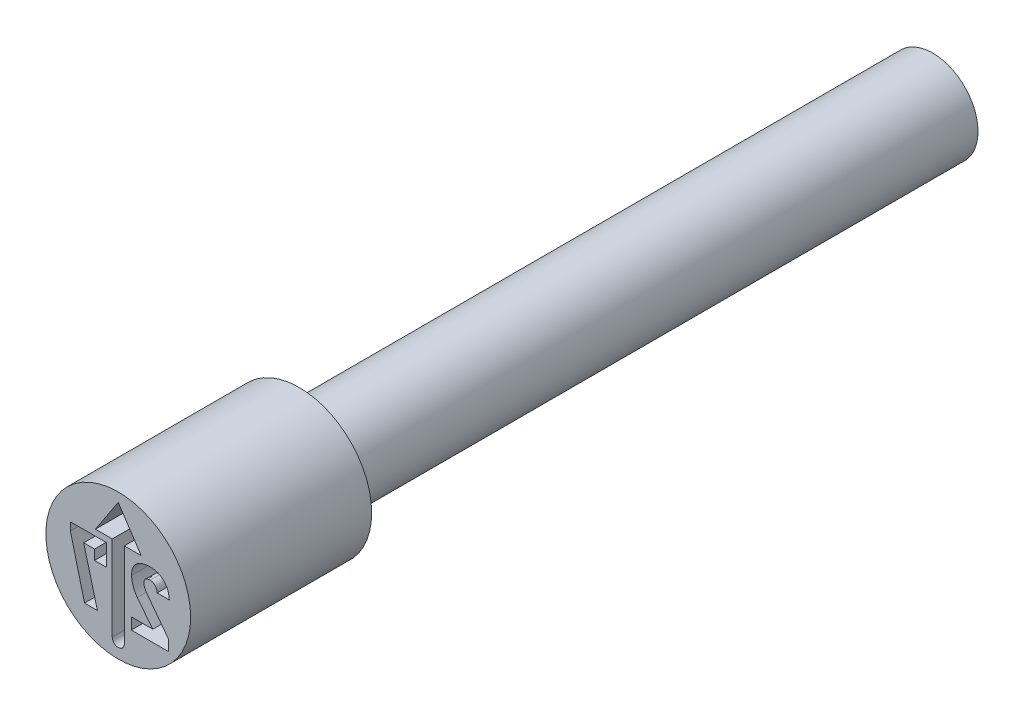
ISO-10303-21;
HEADER;
FILE_DESCRIPTION(('STEP AP214'),'2;1');
FILE_NAME('part.step','',(''),(''),'','','');
FILE_SCHEMA(('AUTOMOTIVE_DESIGN { 1 0 10303 214 1 1 1 1 }'));
ENDSEC;
DATA;
#1=APPLICATION_CONTEXT('core data for automotive mechanical design processes');
#2=APPLICATION_PROTOCOL_DEFINITION('international standard','automotive_design',2000,#1);
#3=PRODUCT_CONTEXT('',#1,'mechanical');
#4=PRODUCT('Part','Part','',(#3));
#5=PRODUCT_RELATED_PRODUCT_CATEGORY('part','',(#4));
#6=PRODUCT_DEFINITION_FORMATION('','',#4);
#7=PRODUCT_DEFINITION_CONTEXT('part definition',#1,'design');
#8=PRODUCT_DEFINITION('design','',#6,#7);
#9=PRODUCT_DEFINITION_SHAPE('','',#8);
#10=(LENGTH_UNIT() NAMED_UNIT(*) SI_UNIT(.MILLI.,.METRE.));
#11=(NAMED_UNIT(*) PLANE_ANGLE_UNIT() SI_UNIT($,.RADIAN.));
#12=(NAMED_UNIT(*) SI_UNIT($,.STERADIAN.) SOLID_ANGLE_UNIT());
#13=UNCERTAINTY_MEASURE_WITH_UNIT(LENGTH_MEASURE(1.E-05),#10,'distance_accuracy_value','');
#14=(GEOMETRIC_REPRESENTATION_CONTEXT(3) GLOBAL_UNCERTAINTY_ASSIGNED_CONTEXT((#13)) GLOBAL_UNIT_ASSIGNED_CONTEXT((#10,
#11,#12)) REPRESENTATION_CONTEXT('',''));
#15=CARTESIAN_POINT('',(0.,0.,0.));
#16=DIRECTION('',(0.,0.,1.));
#17=DIRECTION('',(1.,0.,0.));
#18=AXIS2_PLACEMENT_3D('',#15,#16,#17);
#19=CARTESIAN_POINT('',(0.,0.5,-2.));
#20=DIRECTION('',(0.,0.,1.));
#21=DIRECTION('',(1.,0.,0.));
#22=AXIS2_PLACEMENT_3D('',#19,#20,#21);
#23=PLANE('',#22);
#24=CARTESIAN_POINT('',(0.,0.,-2.));
#25=DIRECTION('',(0.,0.,1.));
#26=DIRECTION('',(1.,0.,0.));
#27=AXIS2_PLACEMENT_3D('',#24,#25,#26);
#28=CIRCLE('',#27,0.8);
#29=CARTESIAN_POINT('',(0.8,0.,-2.));
#30=VERTEX_POINT('',#29);
#31=EDGE_CURVE('E11',#30,#30,#28,.T.);
#32=ORIENTED_EDGE('',*,*,#31,.F.);
#33=EDGE_LOOP('',(#32));
#34=FACE_BOUND('',#33,.T.);
#35=CARTESIAN_POINT('',(0.,0.,-2.));
#36=DIRECTION('',(0.,0.,1.));
#37=DIRECTION('',(1.,0.,0.));
#38=AXIS2_PLACEMENT_3D('',#35,#36,#37);
#39=CIRCLE('',#38,0.5);
#40=CARTESIAN_POINT('',(0.5,0.,-2.));
#41=VERTEX_POINT('',#40);
#42=EDGE_CURVE('E430',#41,#41,#39,.T.);
#43=ORIENTED_EDGE('',*,*,#42,.T.);
#44=EDGE_LOOP('',(#43));
#45=FACE_BOUND('',#44,.T.);
#46=ADVANCED_FACE('F39',(#34,#45),#23,.F.);
#47=CARTESIAN_POINT('',(0.,0.,-0.403888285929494));
#48=DIRECTION('',(0.,0.,1.));
#49=DIRECTION('',(1.,0.,0.));
#50=AXIS2_PLACEMENT_3D('',#47,#48,#49);
#51=CYLINDRICAL_SURFACE('',#50,0.8);
#52=CARTESIAN_POINT('',(0.,0.,0.));
#53=DIRECTION('',(0.,0.,1.));
#54=DIRECTION('',(1.,0.,0.));
#55=AXIS2_PLACEMENT_3D('',#52,#53,#54);
#56=CIRCLE('',#55,0.8);
#57=CARTESIAN_POINT('',(0.8,0.,0.));
#58=VERTEX_POINT('',#57);
#59=EDGE_CURVE('E46',#58,#58,#56,.T.);
#60=ORIENTED_EDGE('',*,*,#59,.F.);
#61=EDGE_LOOP('',(#60));
#62=FACE_BOUND('',#61,.T.);
#63=ORIENTED_EDGE('',*,*,#31,.T.);
#64=EDGE_LOOP('',(#63));
#65=FACE_BOUND('',#64,.T.);
#66=ADVANCED_FACE('F415',(#62,#65),#51,.T.);
#67=CARTESIAN_POINT('',(0.,0.8,0.));
#68=DIRECTION('',(0.,0.,-1.));
#69=DIRECTION('',(-1.,0.,0.));
#70=AXIS2_PLACEMENT_3D('',#67,#68,#69);
#71=PLANE('',#70);
#72=DIRECTION('',(0.,-1.,0.));
#73=VECTOR('',#72,1.);
#74=CARTESIAN_POINT('',(-0.528963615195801,0.25,0.));
#75=LINE('',#74,#73);
#76=CARTESIAN_POINT('',(-0.528963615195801,0.25,0.));
#77=VERTEX_POINT('',#76);
#78=CARTESIAN_POINT('',(-0.528963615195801,0.162215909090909,0.));
#79=VERTEX_POINT('',#78);
#80=EDGE_CURVE('E297',#77,#79,#75,.T.);
#81=ORIENTED_EDGE('',*,*,#80,.F.);
#82=DIRECTION('',(-1.,0.,0.));
#83=VECTOR('',#82,1.);
#84=CARTESIAN_POINT('',(-0.130668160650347,0.25,0.));
#85=LINE('',#84,#83);
#86=CARTESIAN_POINT('',(-0.130668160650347,0.25,0.));
#87=VERTEX_POINT('',#86);
#88=EDGE_CURVE('E53',#87,#77,#85,.T.);
#89=ORIENTED_EDGE('',*,*,#88,.F.);
#90=DIRECTION('',(0.,1.,0.));
#91=VECTOR('',#90,1.);
#92=CARTESIAN_POINT('',(-0.130668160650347,0.0136363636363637,0.));
#93=LINE('',#92,#91);
#94=CARTESIAN_POINT('',(-0.130668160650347,0.0136363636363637,0.));
#95=VERTEX_POINT('',#94);
#96=EDGE_CURVE('E274',#95,#87,#93,.T.);
#97=ORIENTED_EDGE('',*,*,#96,.F.);
#98=DIRECTION('',(1.,0.,0.));
#99=VECTOR('',#98,1.);
#100=CARTESIAN_POINT('',(-0.262060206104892,0.0136363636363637,0.));
#101=LINE('',#100,#99);
#102=CARTESIAN_POINT('',(-0.262060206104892,0.0136363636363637,0.));
#103=VERTEX_POINT('',#102);
#104=EDGE_CURVE('E277',#103,#95,#101,.T.);
#105=ORIENTED_EDGE('',*,*,#104,.F.);
#106=DIRECTION('',(0.,-1.,0.));
#107=VECTOR('',#106,1.);
#108=CARTESIAN_POINT('',(-0.262060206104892,0.122727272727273,0.));
#109=LINE('',#108,#107);
#110=CARTESIAN_POINT('',(-0.262060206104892,0.122727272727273,0.));
#111=VERTEX_POINT('',#110);
#112=EDGE_CURVE('E311',#111,#103,#109,.T.);
#113=ORIENTED_EDGE('',*,*,#112,.F.);
#114=DIRECTION('',(1.,0.,0.));
#115=VECTOR('',#114,1.);
#116=CARTESIAN_POINT('',(-0.38180452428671,0.122727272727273,0.));
#117=LINE('',#116,#115);
#118=CARTESIAN_POINT('',(-0.38180452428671,0.122727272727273,0.));
#119=VERTEX_POINT('',#118);
#120=EDGE_CURVE('E308',#119,#111,#117,.T.);
#121=ORIENTED_EDGE('',*,*,#120,.F.);
#122=DIRECTION('',(-0.255602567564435,0.966781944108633,0.));
#123=VECTOR('',#122,1.);
#124=CARTESIAN_POINT('',(-0.230384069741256,-0.45,0.));
#125=LINE('',#124,#123);
#126=CARTESIAN_POINT('',(-0.230384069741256,-0.45,0.));
#127=VERTEX_POINT('',#126);
#128=EDGE_CURVE('E305',#127,#119,#125,.T.);
#129=ORIENTED_EDGE('',*,*,#128,.F.);
#130=DIRECTION('',(1.,0.,0.));
#131=VECTOR('',#130,1.);
#132=CARTESIAN_POINT('',(-0.372713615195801,-0.45,0.));
#133=LINE('',#132,#131);
#134=CARTESIAN_POINT('',(-0.372713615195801,-0.45,0.));
#135=VERTEX_POINT('',#134);
#136=EDGE_CURVE('E302',#135,#127,#133,.T.);
#137=ORIENTED_EDGE('',*,*,#136,.F.);
#138=DIRECTION('',(0.247293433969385,-0.968940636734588,0.));
#139=VECTOR('',#138,1.);
#140=CARTESIAN_POINT('',(-0.528963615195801,0.162215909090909,0.));
#141=LINE('',#140,#139);
#142=EDGE_CURVE('E299',#79,#135,#141,.T.);
#143=ORIENTED_EDGE('',*,*,#142,.F.);
#144=EDGE_LOOP('',(#81,#89,#97,#105,#113,#121,#129,#137,#143));
#145=FACE_BOUND('',#144,.T.);
#146=DIRECTION('',(0.,1.,0.));
#147=VECTOR('',#146,1.);
#148=CARTESIAN_POINT('',(0.55575797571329,-0.45,0.));
#149=LINE('',#148,#147);
#150=CARTESIAN_POINT('',(0.55575797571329,-0.45,0.));
#151=VERTEX_POINT('',#150);
#152=CARTESIAN_POINT('',(0.55575797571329,-0.330965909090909,0.));
#153=VERTEX_POINT('',#152);
#154=EDGE_CURVE('E602',#151,#153,#149,.T.);
#155=ORIENTED_EDGE('',*,*,#154,.F.);
#156=DIRECTION('',(1.,0.,0.));
#157=VECTOR('',#156,1.);
#158=CARTESIAN_POINT('',(0.143542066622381,-0.45,0.));
#159=LINE('',#158,#157);
#160=CARTESIAN_POINT('',(0.143542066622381,-0.45,0.));
#161=VERTEX_POINT('',#160);
#162=EDGE_CURVE('E61',#161,#151,#159,.T.);
#163=ORIENTED_EDGE('',*,*,#162,.F.);
#164=DIRECTION('',(0.,-1.,0.));
#165=VECTOR('',#164,1.);
#166=CARTESIAN_POINT('',(0.143542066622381,-0.322727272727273,0.));
#167=LINE('',#166,#165);
#168=CARTESIAN_POINT('',(0.143542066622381,-0.322727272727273,0.));
#169=VERTEX_POINT('',#168);
#170=EDGE_CURVE('E335',#169,#161,#167,.T.);
#171=ORIENTED_EDGE('',*,*,#170,.F.);
#172=DIRECTION('',(-1.,0.,0.));
#173=VECTOR('',#172,1.);
#174=CARTESIAN_POINT('',(0.381752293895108,-0.322727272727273,0.));
#175=LINE('',#174,#173);
#176=CARTESIAN_POINT('',(0.381752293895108,-0.322727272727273,0.));
#177=VERTEX_POINT('',#176);
#178=EDGE_CURVE('E530',#177,#169,#175,.T.);
#179=ORIENTED_EDGE('',*,*,#178,.F.);
#180=DIRECTION('',(0.618183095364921,-0.786034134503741,0.));
#181=VECTOR('',#180,1.);
#182=CARTESIAN_POINT('',(0.210161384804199,-0.104545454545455,0.));
#183=LINE('',#182,#181);
#184=CARTESIAN_POINT('',(0.210161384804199,-0.104545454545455,0.));
#185=VERTEX_POINT('',#184);
#186=EDGE_CURVE('E533',#185,#177,#183,.T.);
#187=ORIENTED_EDGE('',*,*,#186,.F.);
#188=CARTESIAN_POINT('',(0.147377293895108,0.0755681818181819,0.));
#189=CARTESIAN_POINT('',(0.147558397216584,0.0676034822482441,0.));
#190=CARTESIAN_POINT('',(0.147920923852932,0.0516600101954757,0.));
#191=CARTESIAN_POINT('',(0.151193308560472,0.027798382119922,0.));
#192=CARTESIAN_POINT('',(0.156466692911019,0.0040585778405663,0.));
#193=CARTESIAN_POINT('',(0.163708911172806,-0.0194447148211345,0.));
#194=CARTESIAN_POINT('',(0.172705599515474,-0.0423043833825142,0.));
#195=CARTESIAN_POINT('',(0.183503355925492,-0.0642073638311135,0.));
#196=CARTESIAN_POINT('',(0.195690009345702,-0.0851633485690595,0.));
#197=CARTESIAN_POINT('',(0.205346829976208,-0.0980971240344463,0.));
#198=CARTESIAN_POINT('',(0.210161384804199,-0.104545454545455,0.));
#199=B_SPLINE_CURVE_WITH_KNOTS('',3,(#188,#189,#190,#191,#192,#193,#194,#195,#196,#197,#198),
.UNSPECIFIED.,.F.,.F.,(4,1,1,1,1,1,1,1,4),(0.,0.123046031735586,0.246309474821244,
0.371480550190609,0.498560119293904,0.626024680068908,0.750715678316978,0.875715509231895,1.),.UNSPECIFIED.);
#200=CARTESIAN_POINT('',(0.147377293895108,0.0755681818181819,0.));
#201=VERTEX_POINT('',#200);
#202=EDGE_CURVE('E536',#201,#185,#199,.T.);
#203=ORIENTED_EDGE('',*,*,#202,.F.);
#204=DIRECTION('',(0.,-1.,0.));
#205=VECTOR('',#204,1.);
#206=CARTESIAN_POINT('',(0.147377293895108,0.0761363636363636,0.));
#207=LINE('',#206,#205);
#208=CARTESIAN_POINT('',(0.147377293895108,0.0761363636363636,0.));
#209=VERTEX_POINT('',#208);
#210=EDGE_CURVE('E541',#209,#201,#207,.T.);
#211=ORIENTED_EDGE('',*,*,#210,.F.);
#212=CARTESIAN_POINT('',(0.353485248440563,0.259090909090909,0.));
#213=CARTESIAN_POINT('',(0.345524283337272,0.258977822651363,0.));
#214=CARTESIAN_POINT('',(0.330041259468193,0.258757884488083,0.));
#215=CARTESIAN_POINT('',(0.307500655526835,0.256383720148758,0.));
#216=CARTESIAN_POINT('',(0.2862923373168,0.252800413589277,0.));
#217=CARTESIAN_POINT('',(0.266450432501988,0.24755820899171,0.));
#218=CARTESIAN_POINT('',(0.248054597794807,0.240720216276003,0.));
#219=CARTESIAN_POINT('',(0.231049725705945,0.232475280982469,0.));
#220=CARTESIAN_POINT('',(0.215400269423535,0.222753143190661,0.));
#221=CARTESIAN_POINT('',(0.20122607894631,0.211533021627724,0.));
#222=CARTESIAN_POINT('',(0.188472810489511,0.19901876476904,0.));
#223=CARTESIAN_POINT('',(0.177495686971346,0.185083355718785,0.));
#224=CARTESIAN_POINT('',(0.167993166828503,0.170008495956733,0.));
#225=CARTESIAN_POINT('',(0.160565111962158,0.153501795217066,0.));
#226=CARTESIAN_POINT('',(0.154449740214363,0.13595143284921,0.));
#227=CARTESIAN_POINT('',(0.150490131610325,0.117042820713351,0.));
#228=CARTESIAN_POINT('',(0.14782185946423,0.0969985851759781,0.));
#229=CARTESIAN_POINT('',(0.14752782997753,0.0832006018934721,0.));
#230=CARTESIAN_POINT('',(0.147377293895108,0.0761363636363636,0.));
#231=B_SPLINE_CURVE_WITH_KNOTS('',3,(#212,#213,#214,#215,#216,#217,#218,#219,#220,#221,#222,
#223,#224,#225,#226,#227,#228,#229,#230),.UNSPECIFIED.,.F.,.F.,(4,1,1,1,1,1,1,1,1,1,1,1,1,1,1,1,
4),(0.,0.0762312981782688,0.148259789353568,0.216860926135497,0.28210063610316,
0.344528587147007,0.404571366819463,0.462840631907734,0.520642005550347,0.577409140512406,
0.633580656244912,0.690215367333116,0.747647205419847,0.806597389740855,0.867894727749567,
0.932365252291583,1.),.UNSPECIFIED.);
#232=CARTESIAN_POINT('',(0.353485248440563,0.259090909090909,0.));
#233=VERTEX_POINT('',#232);
#234=EDGE_CURVE('E547',#233,#209,#231,.T.);
#235=ORIENTED_EDGE('',*,*,#234,.F.);
#236=CARTESIAN_POINT('',(0.564422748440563,0.0490056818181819,0.));
#237=CARTESIAN_POINT('',(0.563758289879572,0.0571196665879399,0.));
#238=CARTESIAN_POINT('',(0.562461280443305,0.0729579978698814,0.));
#239=CARTESIAN_POINT('',(0.558209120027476,0.0958688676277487,0.));
#240=CARTESIAN_POINT('',(0.552713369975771,0.117449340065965,0.));
#241=CARTESIAN_POINT('',(0.545722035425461,0.137695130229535,0.));
#242=CARTESIAN_POINT('',(0.536738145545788,0.156371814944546,0.));
#243=CARTESIAN_POINT('',(0.526644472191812,0.1738698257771,0.));
#244=CARTESIAN_POINT('',(0.51450431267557,0.189647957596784,0.));
#245=CARTESIAN_POINT('',(0.501215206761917,0.204234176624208,0.));
#246=CARTESIAN_POINT('',(0.486413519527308,0.217081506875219,0.));
#247=CARTESIAN_POINT('',(0.470630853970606,0.228414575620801,0.));
#248=CARTESIAN_POINT('',(0.45362855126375,0.237845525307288,0.));
#249=CARTESIAN_POINT('',(0.435665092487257,0.24566905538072,0.));
#250=CARTESIAN_POINT('',(0.416541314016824,0.251606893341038,0.));
#251=CARTESIAN_POINT('',(0.396507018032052,0.256054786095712,0.));
#252=CARTESIAN_POINT('',(0.375332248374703,0.258619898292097,0.));
#253=CARTESIAN_POINT('',(0.360878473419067,0.258931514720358,0.));
#254=CARTESIAN_POINT('',(0.353485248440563,0.259090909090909,0.));
#255=B_SPLINE_CURVE_WITH_KNOTS('',3,(#236,#237,#238,#239,#240,#241,#242,#243,#244,#245,#246,
#247,#248,#249,#250,#251,#252,#253,#254),.UNSPECIFIED.,.F.,.F.,(4,1,1,1,1,1,1,1,1,1,1,1,1,1,1,1,
4),(0.,0.0733268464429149,0.143132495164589,0.209679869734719,0.273918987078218,
0.33576228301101,0.396210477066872,0.455608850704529,0.514796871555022,0.573764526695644,
0.631900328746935,0.689592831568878,0.748648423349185,0.808163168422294,0.86976604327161,
0.933384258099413,1.),.UNSPECIFIED.);
#256=CARTESIAN_POINT('',(0.564422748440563,0.0490056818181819,0.));
#257=VERTEX_POINT('',#256);
#258=EDGE_CURVE('E552',#257,#233,#255,.T.);
#259=ORIENTED_EDGE('',*,*,#258,.F.);
#260=DIRECTION('',(0.,1.,0.));
#261=VECTOR('',#260,1.);
#262=CARTESIAN_POINT('',(0.564422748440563,0.0485795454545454,0.));
#263=LINE('',#262,#261);
#264=CARTESIAN_POINT('',(0.564422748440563,0.0485795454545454,0.));
#265=VERTEX_POINT('',#264);
#266=EDGE_CURVE('E560',#265,#257,#263,.T.);
#267=ORIENTED_EDGE('',*,*,#266,.F.);
#268=DIRECTION('',(1.,0.,0.));
#269=VECTOR('',#268,1.);
#270=CARTESIAN_POINT('',(0.429763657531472,0.0485795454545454,0.));
#271=LINE('',#270,#269);
#272=CARTESIAN_POINT('',(0.429763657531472,0.0485795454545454,0.));
#273=VERTEX_POINT('',#272);
#274=EDGE_CURVE('E566',#273,#265,#271,.T.);
#275=ORIENTED_EDGE('',*,*,#274,.F.);
#276=DIRECTION('',(0.,-1.,0.));
#277=VECTOR('',#276,1.);
#278=CARTESIAN_POINT('',(0.429763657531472,0.0490056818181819,0.));
#279=LINE('',#278,#277);
#280=CARTESIAN_POINT('',(0.429763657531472,0.0490056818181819,0.));
#281=VERTEX_POINT('',#280);
#282=EDGE_CURVE('E569',#281,#273,#279,.T.);
#283=ORIENTED_EDGE('',*,*,#282,.F.);
#284=CARTESIAN_POINT('',(0.352490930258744,0.131818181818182,0.));
#285=CARTESIAN_POINT('',(0.357636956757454,0.131617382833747,0.));
#286=CARTESIAN_POINT('',(0.367635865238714,0.131227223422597,0.));
#287=CARTESIAN_POINT('',(0.381791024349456,0.12690315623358,0.));
#288=CARTESIAN_POINT('',(0.394546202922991,0.12012054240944,0.));
#289=CARTESIAN_POINT('',(0.405542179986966,0.110442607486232,0.));
#290=CARTESIAN_POINT('',(0.414647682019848,0.0982915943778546,0.));
#291=CARTESIAN_POINT('',(0.422037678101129,0.0839827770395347,0.));
#292=CARTESIAN_POINT('',(0.427056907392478,0.0672578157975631,0.));
#293=CARTESIAN_POINT('',(0.42883237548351,0.0552854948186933,0.));
#294=CARTESIAN_POINT('',(0.429763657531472,0.0490056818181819,0.));
#295=B_SPLINE_CURVE_WITH_KNOTS('',3,(#284,#285,#286,#287,#288,#289,#290,#291,#292,#293,#294),
.UNSPECIFIED.,.F.,.F.,(4,1,1,1,1,1,1,1,4),(0.,0.122603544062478,0.238222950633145,
0.350089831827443,0.465559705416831,0.58502806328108,0.711014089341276,0.848418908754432,1.),.UNSPECIFIED.);
#296=CARTESIAN_POINT('',(0.352490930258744,0.131818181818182,0.));
#297=VERTEX_POINT('',#296);
#298=EDGE_CURVE('E572',#297,#281,#295,.T.);
#299=ORIENTED_EDGE('',*,*,#298,.F.);
#300=CARTESIAN_POINT('',(0.282604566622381,0.0724431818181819,0.));
#301=CARTESIAN_POINT('',(0.282798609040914,0.0769189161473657,0.));
#302=CARTESIAN_POINT('',(0.283170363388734,0.0854937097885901,0.));
#303=CARTESIAN_POINT('',(0.286672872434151,0.0975757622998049,0.));
#304=CARTESIAN_POINT('',(0.292413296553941,0.108097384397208,0.));
#305=CARTESIAN_POINT('',(0.30063496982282,0.116788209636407,0.));
#306=CARTESIAN_POINT('',(0.310870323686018,0.123662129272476,0.));
#307=CARTESIAN_POINT('',(0.323117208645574,0.128506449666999,0.));
#308=CARTESIAN_POINT('',(0.33721538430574,0.131284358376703,0.));
#309=CARTESIAN_POINT('',(0.347222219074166,0.13163405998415,0.));
#310=CARTESIAN_POINT('',(0.352490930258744,0.131818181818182,0.));
#311=B_SPLINE_CURVE_WITH_KNOTS('',3,(#300,#301,#302,#303,#304,#305,#306,#307,#308,#309,#310),
.UNSPECIFIED.,.F.,.F.,(4,1,1,1,1,1,1,1,4),(0.,0.128749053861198,0.246662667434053,
0.359069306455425,0.471077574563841,0.588039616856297,0.711712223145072,0.848213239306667,1.),.UNSPECIFIED.);
#312=CARTESIAN_POINT('',(0.282604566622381,0.0724431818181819,0.));
#313=VERTEX_POINT('',#312);
#314=EDGE_CURVE('E577',#313,#297,#311,.T.);
#315=ORIENTED_EDGE('',*,*,#314,.F.);
#316=DIRECTION('',(0.,1.,0.));
#317=VECTOR('',#316,1.);
#318=CARTESIAN_POINT('',(0.282604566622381,0.0714488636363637,0.));
#319=LINE('',#318,#317);
#320=CARTESIAN_POINT('',(0.282604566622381,0.0714488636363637,0.));
#321=VERTEX_POINT('',#320);
#322=EDGE_CURVE('E585',#321,#313,#319,.T.);
#323=ORIENTED_EDGE('',*,*,#322,.F.);
#324=CARTESIAN_POINT('',(0.316553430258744,-0.0140625,0.));
#325=CARTESIAN_POINT('',(0.311543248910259,-0.00700288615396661,0.));
#326=CARTESIAN_POINT('',(0.301781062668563,0.00675255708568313,0.));
#327=CARTESIAN_POINT('',(0.292945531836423,0.0256428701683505,0.));
#328=CARTESIAN_POINT('',(0.287441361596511,0.0404531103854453,0.));
#329=CARTESIAN_POINT('',(0.284818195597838,0.0511934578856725,0.));
#330=CARTESIAN_POINT('',(0.282946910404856,0.0614407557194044,0.));
#331=CARTESIAN_POINT('',(0.282716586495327,0.0681740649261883,0.));
#332=CARTESIAN_POINT('',(0.282604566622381,0.0714488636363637,0.));
#333=B_SPLINE_CURVE_WITH_KNOTS('',3,(#324,#325,#326,#327,#328,#329,#330,#331,#332),
.UNSPECIFIED.,.F.,.F.,(4,1,1,1,1,1,4),(0.,0.277375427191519,0.540457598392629,0.666416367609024,
0.784009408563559,0.894951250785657,1.),.UNSPECIFIED.);
#334=CARTESIAN_POINT('',(0.316553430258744,-0.0140625,0.));
#335=VERTEX_POINT('',#334);
#336=EDGE_CURVE('E591',#335,#321,#333,.T.);
#337=ORIENTED_EDGE('',*,*,#336,.F.);
#338=DIRECTION('',(-0.602458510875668,0.798150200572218,0.));
#339=VECTOR('',#338,1.);
#340=CARTESIAN_POINT('',(0.55575797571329,-0.330965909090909,0.));
#341=LINE('',#340,#339);
#342=EDGE_CURVE('E596',#153,#335,#341,.T.);
#343=ORIENTED_EDGE('',*,*,#342,.F.);
#344=EDGE_LOOP('',(#155,#163,#171,#179,#187,#203,#211,#235,#259,#267,#275,#283,#299,#315,#323,
#337,#343));
#345=FACE_BOUND('',#344,.T.);
#346=DIRECTION('',(0.,1.,0.));
#347=VECTOR('',#346,1.);
#348=CARTESIAN_POINT('',(0.0666655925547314,0.31722300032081,0.));
#349=LINE('',#348,#347);
#350=CARTESIAN_POINT('',(0.0666655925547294,-0.62165664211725,0.));
#351=VERTEX_POINT('',#350);
#352=CARTESIAN_POINT('',(0.0666655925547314,0.31722300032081,0.));
#353=VERTEX_POINT('',#352);
#354=EDGE_CURVE('E469',#351,#353,#349,.T.);
#355=ORIENTED_EDGE('',*,*,#354,.F.);
#356=CARTESIAN_POINT('',(0.,-0.62165664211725,0.));
#357=DIRECTION('',(0.,0.,1.));
#358=DIRECTION('',(1.,0.,0.));
#359=AXIS2_PLACEMENT_3D('',#356,#357,#358);
#360=CIRCLE('',#359,0.0666655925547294);
#361=CARTESIAN_POINT('',(-0.0666655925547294,-0.62165664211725,0.));
#362=VERTEX_POINT('',#361);
#363=EDGE_CURVE('E472',#362,#351,#360,.T.);
#364=ORIENTED_EDGE('',*,*,#363,.F.);
#365=DIRECTION('',(0.,-1.,0.));
#366=VECTOR('',#365,1.);
#367=CARTESIAN_POINT('',(-0.0666655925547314,0.31722300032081,0.));
#368=LINE('',#367,#366);
#369=CARTESIAN_POINT('',(-0.0666655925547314,0.31722300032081,0.));
#370=VERTEX_POINT('',#369);
#371=EDGE_CURVE('E453',#370,#362,#368,.T.);
#372=ORIENTED_EDGE('',*,*,#371,.F.);
#373=DIRECTION('',(1.,0.,0.));
#374=VECTOR('',#373,1.);
#375=CARTESIAN_POINT('',(-0.252671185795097,0.31722300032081,0.));
#376=LINE('',#375,#374);
#377=CARTESIAN_POINT('',(-0.252671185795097,0.31722300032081,0.));
#378=VERTEX_POINT('',#377);
#379=EDGE_CURVE('E457',#378,#370,#376,.T.);
#380=ORIENTED_EDGE('',*,*,#379,.F.);
#381=DIRECTION('',(-0.550159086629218,-0.835059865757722,0.));
#382=VECTOR('',#381,1.);
#383=CARTESIAN_POINT('',(0.,0.700740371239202,0.));
#384=LINE('',#383,#382);
#385=CARTESIAN_POINT('',(0.,0.700740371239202,0.));
#386=VERTEX_POINT('',#385);
#387=EDGE_CURVE('E460',#386,#378,#384,.T.);
#388=ORIENTED_EDGE('',*,*,#387,.F.);
#389=DIRECTION('',(-0.550159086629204,0.835059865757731,0.));
#390=VECTOR('',#389,1.);
#391=CARTESIAN_POINT('',(0.,0.700740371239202,0.));
#392=LINE('',#391,#390);
#393=CARTESIAN_POINT('',(0.252671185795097,0.31722300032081,0.));
#394=VERTEX_POINT('',#393);
#395=EDGE_CURVE('E463',#394,#386,#392,.T.);
#396=ORIENTED_EDGE('',*,*,#395,.F.);
#397=DIRECTION('',(1.,0.,0.));
#398=VECTOR('',#397,1.);
#399=CARTESIAN_POINT('',(0.252671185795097,0.31722300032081,0.));
#400=LINE('',#399,#398);
#401=EDGE_CURVE('E466',#353,#394,#400,.T.);
#402=ORIENTED_EDGE('',*,*,#401,.F.);
#403=EDGE_LOOP('',(#355,#364,#372,#380,#388,#396,#402));
#404=FACE_BOUND('',#403,.T.);
#405=ORIENTED_EDGE('',*,*,#59,.T.);
#406=EDGE_LOOP('',(#405));
#407=FACE_BOUND('',#406,.T.);
#408=ADVANCED_FACE('F412',(#145,#345,#404,#407),#71,.F.);
#409=CARTESIAN_POINT('',(0.,0.,-9.));
#410=DIRECTION('',(0.,0.,1.));
#411=DIRECTION('',(1.,0.,0.));
#412=AXIS2_PLACEMENT_3D('',#409,#410,#411);
#413=PLANE('',#412);
#414=CARTESIAN_POINT('',(0.,0.,-9.));
#415=DIRECTION('',(0.,0.,1.));
#416=DIRECTION('',(1.,0.,0.));
#417=AXIS2_PLACEMENT_3D('',#414,#415,#416);
#418=CIRCLE('',#417,0.500000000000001);
#419=CARTESIAN_POINT('',(0.500000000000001,0.,-9.));
#420=VERTEX_POINT('',#419);
#421=EDGE_CURVE('E431',#420,#420,#418,.T.);
#422=ORIENTED_EDGE('',*,*,#421,.F.);
#423=EDGE_LOOP('',(#422));
#424=FACE_BOUND('',#423,.T.);
#425=ADVANCED_FACE('F408',(#424),#413,.F.);
#426=CARTESIAN_POINT('',(0.,0.,-0.403888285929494));
#427=DIRECTION('',(0.,0.,1.));
#428=DIRECTION('',(1.,0.,0.));
#429=AXIS2_PLACEMENT_3D('',#426,#427,#428);
#430=CYLINDRICAL_SURFACE('',#429,0.5);
#431=ORIENTED_EDGE('',*,*,#42,.F.);
#432=EDGE_LOOP('',(#431));
#433=FACE_BOUND('',#432,.T.);
#434=ORIENTED_EDGE('',*,*,#421,.T.);
#435=EDGE_LOOP('',(#434));
#436=FACE_BOUND('',#435,.T.);
#437=ADVANCED_FACE('F404',(#433,#436),#430,.T.);
#438=CARTESIAN_POINT('',(0.,-0.62165664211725,-0.3));
#439=DIRECTION('',(0.,0.,1.));
#440=DIRECTION('',(1.,0.,0.));
#441=AXIS2_PLACEMENT_3D('',#438,#439,#440);
#442=CYLINDRICAL_SURFACE('',#441,0.0666655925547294);
#443=ORIENTED_EDGE('',*,*,#363,.T.);
#444=DIRECTION('',(0.,0.,1.));
#445=VECTOR('',#444,1.);
#446=CARTESIAN_POINT('',(0.0666655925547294,-0.62165664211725,-0.3));
#447=LINE('',#446,#445);
#448=CARTESIAN_POINT('',(0.0666655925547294,-0.62165664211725,-0.3));
#449=VERTEX_POINT('',#448);
#450=EDGE_CURVE('E439',#449,#351,#447,.T.);
#451=ORIENTED_EDGE('',*,*,#450,.F.);
#452=CARTESIAN_POINT('',(0.,-0.62165664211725,-0.3));
#453=DIRECTION('',(0.,0.,1.));
#454=DIRECTION('',(1.,0.,0.));
#455=AXIS2_PLACEMENT_3D('',#452,#453,#454);
#456=CIRCLE('',#455,0.0666655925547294);
#457=CARTESIAN_POINT('',(-0.0666655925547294,-0.62165664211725,-0.3));
#458=VERTEX_POINT('',#457);
#459=EDGE_CURVE('E456',#458,#449,#456,.T.);
#460=ORIENTED_EDGE('',*,*,#459,.F.);
#461=DIRECTION('',(0.,0.,1.));
#462=VECTOR('',#461,1.);
#463=CARTESIAN_POINT('',(-0.0666655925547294,-0.62165664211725,-0.3));
#464=LINE('',#463,#462);
#465=EDGE_CURVE('E432',#458,#362,#464,.T.);
#466=ORIENTED_EDGE('',*,*,#465,.T.);
#467=EDGE_LOOP('',(#443,#451,#460,#466));
#468=FACE_BOUND('',#467,.T.);
#469=ADVANCED_FACE('F382',(#468),#442,.F.);
#470=CARTESIAN_POINT('',(-0.0666655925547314,0.31722300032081,-0.3));
#471=DIRECTION('',(-1.,0.,0.));
#472=DIRECTION('',(0.,-1.,0.));
#473=AXIS2_PLACEMENT_3D('',#470,#471,#472);
#474=PLANE('',#473);
#475=ORIENTED_EDGE('',*,*,#371,.T.);
#476=ORIENTED_EDGE('',*,*,#465,.F.);
#477=DIRECTION('',(0.,-1.,0.));
#478=VECTOR('',#477,1.);
#479=CARTESIAN_POINT('',(-0.0666655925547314,0.31722300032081,-0.3));
#480=LINE('',#479,#478);
#481=CARTESIAN_POINT('',(-0.0666655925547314,0.31722300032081,-0.3));
#482=VERTEX_POINT('',#481);
#483=EDGE_CURVE('E444',#482,#458,#480,.T.);
#484=ORIENTED_EDGE('',*,*,#483,.F.);
#485=DIRECTION('',(0.,0.,1.));
#486=VECTOR('',#485,1.);
#487=CARTESIAN_POINT('',(-0.0666655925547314,0.31722300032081,-0.3));
#488=LINE('',#487,#486);
#489=EDGE_CURVE('E436',#482,#370,#488,.T.);
#490=ORIENTED_EDGE('',*,*,#489,.T.);
#491=EDGE_LOOP('',(#475,#476,#484,#490));
#492=FACE_BOUND('',#491,.T.);
#493=ADVANCED_FACE('F378',(#492),#474,.F.);
#494=CARTESIAN_POINT('',(-0.252671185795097,0.31722300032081,-0.3));
#495=DIRECTION('',(0.,-1.,0.));
#496=DIRECTION('',(0.,0.,-1.));
#497=AXIS2_PLACEMENT_3D('',#494,#495,#496);
#498=PLANE('',#497);
#499=ORIENTED_EDGE('',*,*,#379,.T.);
#500=ORIENTED_EDGE('',*,*,#489,.F.);
#501=DIRECTION('',(1.,0.,0.));
#502=VECTOR('',#501,1.);
#503=CARTESIAN_POINT('',(-0.252671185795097,0.31722300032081,-0.3));
#504=LINE('',#503,#502);
#505=CARTESIAN_POINT('',(-0.252671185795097,0.31722300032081,-0.3));
#506=VERTEX_POINT('',#505);
#507=EDGE_CURVE('E477',#506,#482,#504,.T.);
#508=ORIENTED_EDGE('',*,*,#507,.F.);
#509=DIRECTION('',(0.,0.,1.));
#510=VECTOR('',#509,1.);
#511=CARTESIAN_POINT('',(-0.252671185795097,0.31722300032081,-0.3));
#512=LINE('',#511,#510);
#513=EDGE_CURVE('E450',#506,#378,#512,.T.);
#514=ORIENTED_EDGE('',*,*,#513,.T.);
#515=EDGE_LOOP('',(#499,#500,#508,#514));
#516=FACE_BOUND('',#515,.T.);
#517=ADVANCED_FACE('F381',(#516),#498,.F.);
#518=CARTESIAN_POINT('',(0.,0.700740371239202,-0.3));
#519=DIRECTION('',(-0.835059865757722,0.550159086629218,0.));
#520=DIRECTION('',(-0.550159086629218,-0.835059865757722,0.));
#521=AXIS2_PLACEMENT_3D('',#518,#519,#520);
#522=PLANE('',#521);
#523=ORIENTED_EDGE('',*,*,#387,.T.);
#524=ORIENTED_EDGE('',*,*,#513,.F.);
#525=DIRECTION('',(-0.550159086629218,-0.835059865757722,0.));
#526=VECTOR('',#525,1.);
#527=CARTESIAN_POINT('',(0.,0.700740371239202,-0.3));
#528=LINE('',#527,#526);
#529=CARTESIAN_POINT('',(0.,0.700740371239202,-0.3));
#530=VERTEX_POINT('',#529);
#531=EDGE_CURVE('E480',#530,#506,#528,.T.);
#532=ORIENTED_EDGE('',*,*,#531,.F.);
#533=DIRECTION('',(0.,0.,1.));
#534=VECTOR('',#533,1.);
#535=CARTESIAN_POINT('',(0.,0.700740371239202,-0.3));
#536=LINE('',#535,#534);
#537=EDGE_CURVE('E448',#530,#386,#536,.T.);
#538=ORIENTED_EDGE('',*,*,#537,.T.);
#539=EDGE_LOOP('',(#523,#524,#532,#538));
#540=FACE_BOUND('',#539,.T.);
#541=ADVANCED_FACE('F386',(#540),#522,.F.);
#542=CARTESIAN_POINT('',(0.,0.700740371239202,-0.3));
#543=DIRECTION('',(0.835059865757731,0.550159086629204,0.));
#544=DIRECTION('',(-0.550159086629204,0.835059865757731,0.));
#545=AXIS2_PLACEMENT_3D('',#542,#543,#544);
#546=PLANE('',#545);
#547=ORIENTED_EDGE('',*,*,#395,.T.);
#548=ORIENTED_EDGE('',*,*,#537,.F.);
#549=DIRECTION('',(-0.550159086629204,0.835059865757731,0.));
#550=VECTOR('',#549,1.);
#551=CARTESIAN_POINT('',(0.,0.700740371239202,-0.3));
#552=LINE('',#551,#550);
#553=CARTESIAN_POINT('',(0.252671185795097,0.31722300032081,-0.3));
#554=VERTEX_POINT('',#553);
#555=EDGE_CURVE('E483',#554,#530,#552,.T.);
#556=ORIENTED_EDGE('',*,*,#555,.F.);
#557=DIRECTION('',(0.,0.,1.));
#558=VECTOR('',#557,1.);
#559=CARTESIAN_POINT('',(0.252671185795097,0.31722300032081,-0.3));
#560=LINE('',#559,#558);
#561=EDGE_CURVE('E446',#554,#394,#560,.T.);
#562=ORIENTED_EDGE('',*,*,#561,.T.);
#563=EDGE_LOOP('',(#547,#548,#556,#562));
#564=FACE_BOUND('',#563,.T.);
#565=ADVANCED_FACE('F390',(#564),#546,.F.);
#566=CARTESIAN_POINT('',(0.252671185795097,0.31722300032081,-0.3));
#567=DIRECTION('',(0.,-1.,0.));
#568=DIRECTION('',(0.,0.,-1.));
#569=AXIS2_PLACEMENT_3D('',#566,#567,#568);
#570=PLANE('',#569);
#571=ORIENTED_EDGE('',*,*,#401,.T.);
#572=ORIENTED_EDGE('',*,*,#561,.F.);
#573=DIRECTION('',(1.,0.,0.));
#574=VECTOR('',#573,1.);
#575=CARTESIAN_POINT('',(0.252671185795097,0.31722300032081,-0.3));
#576=LINE('',#575,#574);
#577=CARTESIAN_POINT('',(0.0666655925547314,0.31722300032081,-0.3));
#578=VERTEX_POINT('',#577);
#579=EDGE_CURVE('E486',#578,#554,#576,.T.);
#580=ORIENTED_EDGE('',*,*,#579,.F.);
#581=DIRECTION('',(0.,0.,1.));
#582=VECTOR('',#581,1.);
#583=CARTESIAN_POINT('',(0.0666655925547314,0.31722300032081,-0.3));
#584=LINE('',#583,#582);
#585=EDGE_CURVE('E443',#578,#353,#584,.T.);
#586=ORIENTED_EDGE('',*,*,#585,.T.);
#587=EDGE_LOOP('',(#571,#572,#580,#586));
#588=FACE_BOUND('',#587,.T.);
#589=ADVANCED_FACE('F394',(#588),#570,.F.);
#590=CARTESIAN_POINT('',(0.0666655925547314,0.31722300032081,-0.3));
#591=DIRECTION('',(1.,0.,0.));
#592=DIRECTION('',(0.,1.,0.));
#593=AXIS2_PLACEMENT_3D('',#590,#591,#592);
#594=PLANE('',#593);
#595=ORIENTED_EDGE('',*,*,#354,.T.);
#596=ORIENTED_EDGE('',*,*,#585,.F.);
#597=DIRECTION('',(0.,1.,0.));
#598=VECTOR('',#597,1.);
#599=CARTESIAN_POINT('',(0.0666655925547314,0.31722300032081,-0.3));
#600=LINE('',#599,#598);
#601=EDGE_CURVE('E489',#449,#578,#600,.T.);
#602=ORIENTED_EDGE('',*,*,#601,.F.);
#603=ORIENTED_EDGE('',*,*,#450,.T.);
#604=EDGE_LOOP('',(#595,#596,#602,#603));
#605=FACE_BOUND('',#604,.T.);
#606=ADVANCED_FACE('F376',(#605),#594,.F.);
#607=CARTESIAN_POINT('',(0.,-0.62165664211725,-0.3));
#608=DIRECTION('',(0.,0.,1.));
#609=DIRECTION('',(1.,0.,0.));
#610=AXIS2_PLACEMENT_3D('',#607,#608,#609);
#611=PLANE('',#610);
#612=ORIENTED_EDGE('',*,*,#459,.T.);
#613=ORIENTED_EDGE('',*,*,#601,.T.);
#614=ORIENTED_EDGE('',*,*,#579,.T.);
#615=ORIENTED_EDGE('',*,*,#555,.T.);
#616=ORIENTED_EDGE('',*,*,#531,.T.);
#617=ORIENTED_EDGE('',*,*,#507,.T.);
#618=ORIENTED_EDGE('',*,*,#483,.T.);
#619=EDGE_LOOP('',(#612,#613,#614,#615,#616,#617,#618));
#620=FACE_BOUND('',#619,.T.);
#621=ADVANCED_FACE('F373',(#620),#611,.T.);
#622=CARTESIAN_POINT('',(0.143542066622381,-0.45,-0.3));
#623=DIRECTION('',(0.,-1.,0.));
#624=DIRECTION('',(0.,0.,-1.));
#625=AXIS2_PLACEMENT_3D('',#622,#623,#624);
#626=PLANE('',#625);
#627=ORIENTED_EDGE('',*,*,#162,.T.);
#628=DIRECTION('',(0.,0.,1.));
#629=VECTOR('',#628,1.);
#630=CARTESIAN_POINT('',(0.55575797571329,-0.45,-0.3));
#631=LINE('',#630,#629);
#632=CARTESIAN_POINT('',(0.55575797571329,-0.45,-0.3));
#633=VERTEX_POINT('',#632);
#634=EDGE_CURVE('E494',#633,#151,#631,.T.);
#635=ORIENTED_EDGE('',*,*,#634,.F.);
#636=DIRECTION('',(1.,0.,0.));
#637=VECTOR('',#636,1.);
#638=CARTESIAN_POINT('',(0.143542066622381,-0.45,-0.3));
#639=LINE('',#638,#637);
#640=CARTESIAN_POINT('',(0.143542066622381,-0.45,-0.3));
#641=VERTEX_POINT('',#640);
#642=EDGE_CURVE('E331',#641,#633,#639,.T.);
#643=ORIENTED_EDGE('',*,*,#642,.F.);
#644=DIRECTION('',(0.,0.,1.));
#645=VECTOR('',#644,1.);
#646=CARTESIAN_POINT('',(0.143542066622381,-0.45,-0.3));
#647=LINE('',#646,#645);
#648=EDGE_CURVE('E474',#641,#161,#647,.T.);
#649=ORIENTED_EDGE('',*,*,#648,.T.);
#650=EDGE_LOOP('',(#627,#635,#643,#649));
#651=FACE_BOUND('',#650,.T.);
#652=ADVANCED_FACE('F369',(#651),#626,.F.);
#653=CARTESIAN_POINT('',(0.143542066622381,-0.322727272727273,-0.3));
#654=DIRECTION('',(-1.,0.,0.));
#655=DIRECTION('',(0.,0.,1.));
#656=AXIS2_PLACEMENT_3D('',#653,#654,#655);
#657=PLANE('',#656);
#658=ORIENTED_EDGE('',*,*,#170,.T.);
#659=ORIENTED_EDGE('',*,*,#648,.F.);
#660=DIRECTION('',(0.,-1.,0.));
#661=VECTOR('',#660,1.);
#662=CARTESIAN_POINT('',(0.143542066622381,-0.322727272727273,-0.3));
#663=LINE('',#662,#661);
#664=CARTESIAN_POINT('',(0.143542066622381,-0.322727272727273,-0.3));
#665=VERTEX_POINT('',#664);
#666=EDGE_CURVE('E497',#665,#641,#663,.T.);
#667=ORIENTED_EDGE('',*,*,#666,.F.);
#668=DIRECTION('',(0.,0.,1.));
#669=VECTOR('',#668,1.);
#670=CARTESIAN_POINT('',(0.143542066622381,-0.322727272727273,-0.3));
#671=LINE('',#670,#669);
#672=EDGE_CURVE('E525',#665,#169,#671,.T.);
#673=ORIENTED_EDGE('',*,*,#672,.T.);
#674=EDGE_LOOP('',(#658,#659,#667,#673));
#675=FACE_BOUND('',#674,.T.);
#676=ADVANCED_FACE('F372',(#675),#657,.F.);
#677=CARTESIAN_POINT('',(0.381752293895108,-0.322727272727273,-0.3));
#678=DIRECTION('',(0.,1.,0.));
#679=DIRECTION('',(0.,0.,1.));
#680=AXIS2_PLACEMENT_3D('',#677,#678,#679);
#681=PLANE('',#680);
#682=ORIENTED_EDGE('',*,*,#178,.T.);
#683=ORIENTED_EDGE('',*,*,#672,.F.);
#684=DIRECTION('',(-1.,0.,0.));
#685=VECTOR('',#684,1.);
#686=CARTESIAN_POINT('',(0.381752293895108,-0.322727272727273,-0.3));
#687=LINE('',#686,#685);
#688=CARTESIAN_POINT('',(0.381752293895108,-0.322727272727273,-0.3));
#689=VERTEX_POINT('',#688);
#690=EDGE_CURVE('E608',#689,#665,#687,.T.);
#691=ORIENTED_EDGE('',*,*,#690,.F.);
#692=DIRECTION('',(0.,0.,1.));
#693=VECTOR('',#692,1.);
#694=CARTESIAN_POINT('',(0.381752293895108,-0.322727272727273,-0.3));
#695=LINE('',#694,#693);
#696=EDGE_CURVE('E523',#689,#177,#695,.T.);
#697=ORIENTED_EDGE('',*,*,#696,.T.);
#698=EDGE_LOOP('',(#682,#683,#691,#697));
#699=FACE_BOUND('',#698,.T.);
#700=ADVANCED_FACE('F724',(#699),#681,.F.);
#701=CARTESIAN_POINT('',(0.210161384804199,-0.104545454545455,-0.3));
#702=DIRECTION('',(-0.786034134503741,-0.618183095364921,0.));
#703=DIRECTION('',(0.618183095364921,-0.786034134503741,0.));
#704=AXIS2_PLACEMENT_3D('',#701,#702,#703);
#705=PLANE('',#704);
#706=ORIENTED_EDGE('',*,*,#186,.T.);
#707=ORIENTED_EDGE('',*,*,#696,.F.);
#708=DIRECTION('',(0.618183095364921,-0.786034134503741,0.));
#709=VECTOR('',#708,1.);
#710=CARTESIAN_POINT('',(0.210161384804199,-0.104545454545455,-0.3));
#711=LINE('',#710,#709);
#712=CARTESIAN_POINT('',(0.210161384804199,-0.104545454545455,-0.3));
#713=VERTEX_POINT('',#712);
#714=EDGE_CURVE('E611',#713,#689,#711,.T.);
#715=ORIENTED_EDGE('',*,*,#714,.F.);
#716=DIRECTION('',(0.,0.,1.));
#717=VECTOR('',#716,1.);
#718=CARTESIAN_POINT('',(0.210161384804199,-0.104545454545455,-0.3));
#719=LINE('',#718,#717);
#720=EDGE_CURVE('E521',#713,#185,#719,.T.);
#721=ORIENTED_EDGE('',*,*,#720,.T.);
#722=EDGE_LOOP('',(#706,#707,#715,#721));
#723=FACE_BOUND('',#722,.T.);
#724=ADVANCED_FACE('F631',(#723),#705,.F.);
#725=CARTESIAN_POINT('',(0.147377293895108,0.0755681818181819,-0.3));
#726=CARTESIAN_POINT('',(0.147558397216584,0.0676034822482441,-0.3));
#727=CARTESIAN_POINT('',(0.147920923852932,0.0516600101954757,-0.3));
#728=CARTESIAN_POINT('',(0.151193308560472,0.027798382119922,-0.3));
#729=CARTESIAN_POINT('',(0.156466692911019,0.0040585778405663,-0.3));
#730=CARTESIAN_POINT('',(0.163708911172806,-0.0194447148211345,-0.3));
#731=CARTESIAN_POINT('',(0.172705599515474,-0.0423043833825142,-0.3));
#732=CARTESIAN_POINT('',(0.183503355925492,-0.0642073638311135,-0.3));
#733=CARTESIAN_POINT('',(0.195690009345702,-0.0851633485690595,-0.3));
#734=CARTESIAN_POINT('',(0.205346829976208,-0.0980971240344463,-0.3));
#735=CARTESIAN_POINT('',(0.210161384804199,-0.104545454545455,-0.3));
#736=B_SPLINE_CURVE_WITH_KNOTS('',3,(#725,#726,#727,#728,#729,#730,#731,#732,#733,#734,#735),
.UNSPECIFIED.,.F.,.F.,(4,1,1,1,1,1,1,1,4),(0.,0.123046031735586,0.246309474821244,
0.371480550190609,0.498560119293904,0.626024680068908,0.750715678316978,0.875715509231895,1.),.UNSPECIFIED.);
#737=DIRECTION('',(0.,0.,1.));
#738=VECTOR('',#737,1.);
#739=SURFACE_OF_LINEAR_EXTRUSION('',#736,#738);
#740=ORIENTED_EDGE('',*,*,#202,.T.);
#741=ORIENTED_EDGE('',*,*,#720,.F.);
#742=CARTESIAN_POINT('',(0.147377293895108,0.0755681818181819,-0.3));
#743=VERTEX_POINT('',#742);
#744=EDGE_CURVE('E614',#743,#713,#736,.T.);
#745=ORIENTED_EDGE('',*,*,#744,.F.);
#746=DIRECTION('',(0.,0.,1.));
#747=VECTOR('',#746,1.);
#748=CARTESIAN_POINT('',(0.147377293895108,0.0755681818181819,-0.3));
#749=LINE('',#748,#747);
#750=EDGE_CURVE('E519',#743,#201,#749,.T.);
#751=ORIENTED_EDGE('',*,*,#750,.T.);
#752=EDGE_LOOP('',(#740,#741,#745,#751));
#753=FACE_BOUND('',#752,.T.);
#754=ADVANCED_FACE('F626',(#753),#739,.F.);
#755=CARTESIAN_POINT('',(0.147377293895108,0.0761363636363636,-0.3));
#756=DIRECTION('',(-1.,0.,0.));
#757=DIRECTION('',(0.,0.,1.));
#758=AXIS2_PLACEMENT_3D('',#755,#756,#757);
#759=PLANE('',#758);
#760=ORIENTED_EDGE('',*,*,#210,.T.);
#761=ORIENTED_EDGE('',*,*,#750,.F.);
#762=DIRECTION('',(0.,-1.,0.));
#763=VECTOR('',#762,1.);
#764=CARTESIAN_POINT('',(0.147377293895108,0.0761363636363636,-0.3));
#765=LINE('',#764,#763);
#766=CARTESIAN_POINT('',(0.147377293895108,0.0761363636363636,-0.3));
#767=VERTEX_POINT('',#766);
#768=EDGE_CURVE('E620',#767,#743,#765,.T.);
#769=ORIENTED_EDGE('',*,*,#768,.F.);
#770=DIRECTION('',(0.,0.,1.));
#771=VECTOR('',#770,1.);
#772=CARTESIAN_POINT('',(0.147377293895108,0.0761363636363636,-0.3));
#773=LINE('',#772,#771);
#774=EDGE_CURVE('E517',#767,#209,#773,.T.);
#775=ORIENTED_EDGE('',*,*,#774,.T.);
#776=EDGE_LOOP('',(#760,#761,#769,#775));
#777=FACE_BOUND('',#776,.T.);
#778=ADVANCED_FACE('F630',(#777),#759,.F.);
#779=CARTESIAN_POINT('',(0.353485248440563,0.259090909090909,-0.3));
#780=CARTESIAN_POINT('',(0.345524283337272,0.258977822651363,-0.3));
#781=CARTESIAN_POINT('',(0.330041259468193,0.258757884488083,-0.3));
#782=CARTESIAN_POINT('',(0.307500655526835,0.256383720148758,-0.3));
#783=CARTESIAN_POINT('',(0.2862923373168,0.252800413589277,-0.3));
#784=CARTESIAN_POINT('',(0.266450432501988,0.24755820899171,-0.3));
#785=CARTESIAN_POINT('',(0.248054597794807,0.240720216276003,-0.3));
#786=CARTESIAN_POINT('',(0.231049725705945,0.232475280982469,-0.3));
#787=CARTESIAN_POINT('',(0.215400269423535,0.222753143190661,-0.3));
#788=CARTESIAN_POINT('',(0.20122607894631,0.211533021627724,-0.3));
#789=CARTESIAN_POINT('',(0.188472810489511,0.19901876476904,-0.3));
#790=CARTESIAN_POINT('',(0.177495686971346,0.185083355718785,-0.3));
#791=CARTESIAN_POINT('',(0.167993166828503,0.170008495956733,-0.3));
#792=CARTESIAN_POINT('',(0.160565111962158,0.153501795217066,-0.3));
#793=CARTESIAN_POINT('',(0.154449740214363,0.13595143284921,-0.3));
#794=CARTESIAN_POINT('',(0.150490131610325,0.117042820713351,-0.3));
#795=CARTESIAN_POINT('',(0.14782185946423,0.0969985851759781,-0.3));
#796=CARTESIAN_POINT('',(0.14752782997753,0.0832006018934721,-0.3));
#797=CARTESIAN_POINT('',(0.147377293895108,0.0761363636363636,-0.3));
#798=B_SPLINE_CURVE_WITH_KNOTS('',3,(#779,#780,#781,#782,#783,#784,#785,#786,#787,#788,#789,
#790,#791,#792,#793,#794,#795,#796,#797),.UNSPECIFIED.,.F.,.F.,(4,1,1,1,1,1,1,1,1,1,1,1,1,1,1,1,
4),(0.,0.0762312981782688,0.148259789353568,0.216860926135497,0.28210063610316,
0.344528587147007,0.404571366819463,0.462840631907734,0.520642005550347,0.577409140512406,
0.633580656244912,0.690215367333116,0.747647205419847,0.806597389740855,0.867894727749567,
0.932365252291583,1.),.UNSPECIFIED.);
#799=DIRECTION('',(0.,0.,1.));
#800=VECTOR('',#799,1.);
#801=SURFACE_OF_LINEAR_EXTRUSION('',#798,#800);
#802=ORIENTED_EDGE('',*,*,#234,.T.);
#803=ORIENTED_EDGE('',*,*,#774,.F.);
#804=CARTESIAN_POINT('',(0.353485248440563,0.259090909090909,-0.3));
#805=VERTEX_POINT('',#804);
#806=EDGE_CURVE('E644',#805,#767,#798,.T.);
#807=ORIENTED_EDGE('',*,*,#806,.F.);
#808=DIRECTION('',(0.,0.,1.));
#809=VECTOR('',#808,1.);
#810=CARTESIAN_POINT('',(0.353485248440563,0.259090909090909,-0.3));
#811=LINE('',#810,#809);
#812=EDGE_CURVE('E515',#805,#233,#811,.T.);
#813=ORIENTED_EDGE('',*,*,#812,.T.);
#814=EDGE_LOOP('',(#802,#803,#807,#813));
#815=FACE_BOUND('',#814,.T.);
#816=ADVANCED_FACE('F636',(#815),#801,.F.);
#817=CARTESIAN_POINT('',(0.564422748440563,0.0490056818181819,-0.3));
#818=CARTESIAN_POINT('',(0.563758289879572,0.0571196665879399,-0.3));
#819=CARTESIAN_POINT('',(0.562461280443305,0.0729579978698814,-0.3));
#820=CARTESIAN_POINT('',(0.558209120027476,0.0958688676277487,-0.3));
#821=CARTESIAN_POINT('',(0.552713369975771,0.117449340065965,-0.3));
#822=CARTESIAN_POINT('',(0.545722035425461,0.137695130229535,-0.3));
#823=CARTESIAN_POINT('',(0.536738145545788,0.156371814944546,-0.3));
#824=CARTESIAN_POINT('',(0.526644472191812,0.1738698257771,-0.3));
#825=CARTESIAN_POINT('',(0.51450431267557,0.189647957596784,-0.3));
#826=CARTESIAN_POINT('',(0.501215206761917,0.204234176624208,-0.3));
#827=CARTESIAN_POINT('',(0.486413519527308,0.217081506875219,-0.3));
#828=CARTESIAN_POINT('',(0.470630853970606,0.228414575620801,-0.3));
#829=CARTESIAN_POINT('',(0.45362855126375,0.237845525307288,-0.3));
#830=CARTESIAN_POINT('',(0.435665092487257,0.24566905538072,-0.3));
#831=CARTESIAN_POINT('',(0.416541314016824,0.251606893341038,-0.3));
#832=CARTESIAN_POINT('',(0.396507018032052,0.256054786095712,-0.3));
#833=CARTESIAN_POINT('',(0.375332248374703,0.258619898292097,-0.3));
#834=CARTESIAN_POINT('',(0.360878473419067,0.258931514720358,-0.3));
#835=CARTESIAN_POINT('',(0.353485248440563,0.259090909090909,-0.3));
#836=B_SPLINE_CURVE_WITH_KNOTS('',3,(#817,#818,#819,#820,#821,#822,#823,#824,#825,#826,#827,
#828,#829,#830,#831,#832,#833,#834,#835),.UNSPECIFIED.,.F.,.F.,(4,1,1,1,1,1,1,1,1,1,1,1,1,1,1,1,
4),(0.,0.0733268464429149,0.143132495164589,0.209679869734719,0.273918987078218,
0.33576228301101,0.396210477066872,0.455608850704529,0.514796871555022,0.573764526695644,
0.631900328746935,0.689592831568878,0.748648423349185,0.808163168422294,0.86976604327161,
0.933384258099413,1.),.UNSPECIFIED.);
#837=DIRECTION('',(0.,0.,1.));
#838=VECTOR('',#837,1.);
#839=SURFACE_OF_LINEAR_EXTRUSION('',#836,#838);
#840=ORIENTED_EDGE('',*,*,#258,.T.);
#841=ORIENTED_EDGE('',*,*,#812,.F.);
#842=CARTESIAN_POINT('',(0.564422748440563,0.0490056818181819,-0.3));
#843=VERTEX_POINT('',#842);
#844=EDGE_CURVE('E649',#843,#805,#836,.T.);
#845=ORIENTED_EDGE('',*,*,#844,.F.);
#846=DIRECTION('',(0.,0.,1.));
#847=VECTOR('',#846,1.);
#848=CARTESIAN_POINT('',(0.564422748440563,0.0490056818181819,-0.3));
#849=LINE('',#848,#847);
#850=EDGE_CURVE('E513',#843,#257,#849,.T.);
#851=ORIENTED_EDGE('',*,*,#850,.T.);
#852=EDGE_LOOP('',(#840,#841,#845,#851));
#853=FACE_BOUND('',#852,.T.);
#854=ADVANCED_FACE('F640',(#853),#839,.F.);
#855=CARTESIAN_POINT('',(0.564422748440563,0.0485795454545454,-0.3));
#856=DIRECTION('',(1.,0.,0.));
#857=DIRECTION('',(0.,0.,-1.));
#858=AXIS2_PLACEMENT_3D('',#855,#856,#857);
#859=PLANE('',#858);
#860=ORIENTED_EDGE('',*,*,#266,.T.);
#861=ORIENTED_EDGE('',*,*,#850,.F.);
#862=DIRECTION('',(0.,1.,0.));
#863=VECTOR('',#862,1.);
#864=CARTESIAN_POINT('',(0.564422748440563,0.0485795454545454,-0.3));
#865=LINE('',#864,#863);
#866=CARTESIAN_POINT('',(0.564422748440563,0.0485795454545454,-0.3));
#867=VERTEX_POINT('',#866);
#868=EDGE_CURVE('E658',#867,#843,#865,.T.);
#869=ORIENTED_EDGE('',*,*,#868,.F.);
#870=DIRECTION('',(0.,0.,1.));
#871=VECTOR('',#870,1.);
#872=CARTESIAN_POINT('',(0.564422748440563,0.0485795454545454,-0.3));
#873=LINE('',#872,#871);
#874=EDGE_CURVE('E511',#867,#265,#873,.T.);
#875=ORIENTED_EDGE('',*,*,#874,.T.);
#876=EDGE_LOOP('',(#860,#861,#869,#875));
#877=FACE_BOUND('',#876,.T.);
#878=ADVANCED_FACE('F740',(#877),#859,.F.);
#879=CARTESIAN_POINT('',(0.429763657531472,0.0485795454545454,-0.3));
#880=DIRECTION('',(0.,-1.,0.));
#881=DIRECTION('',(0.,0.,-1.));
#882=AXIS2_PLACEMENT_3D('',#879,#880,#881);
#883=PLANE('',#882);
#884=ORIENTED_EDGE('',*,*,#274,.T.);
#885=ORIENTED_EDGE('',*,*,#874,.F.);
#886=DIRECTION('',(1.,0.,0.));
#887=VECTOR('',#886,1.);
#888=CARTESIAN_POINT('',(0.429763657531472,0.0485795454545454,-0.3));
#889=LINE('',#888,#887);
#890=CARTESIAN_POINT('',(0.429763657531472,0.0485795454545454,-0.3));
#891=VERTEX_POINT('',#890);
#892=EDGE_CURVE('E664',#891,#867,#889,.T.);
#893=ORIENTED_EDGE('',*,*,#892,.F.);
#894=DIRECTION('',(0.,0.,1.));
#895=VECTOR('',#894,1.);
#896=CARTESIAN_POINT('',(0.429763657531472,0.0485795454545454,-0.3));
#897=LINE('',#896,#895);
#898=EDGE_CURVE('E509',#891,#273,#897,.T.);
#899=ORIENTED_EDGE('',*,*,#898,.T.);
#900=EDGE_LOOP('',(#884,#885,#893,#899));
#901=FACE_BOUND('',#900,.T.);
#902=ADVANCED_FACE('F743',(#901),#883,.F.);
#903=CARTESIAN_POINT('',(0.429763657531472,0.0490056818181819,-0.3));
#904=DIRECTION('',(-1.,0.,0.));
#905=DIRECTION('',(0.,0.,1.));
#906=AXIS2_PLACEMENT_3D('',#903,#904,#905);
#907=PLANE('',#906);
#908=ORIENTED_EDGE('',*,*,#282,.T.);
#909=ORIENTED_EDGE('',*,*,#898,.F.);
#910=DIRECTION('',(0.,-1.,0.));
#911=VECTOR('',#910,1.);
#912=CARTESIAN_POINT('',(0.429763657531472,0.0490056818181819,-0.3));
#913=LINE('',#912,#911);
#914=CARTESIAN_POINT('',(0.429763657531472,0.0490056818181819,-0.3));
#915=VERTEX_POINT('',#914);
#916=EDGE_CURVE('E667',#915,#891,#913,.T.);
#917=ORIENTED_EDGE('',*,*,#916,.F.);
#918=DIRECTION('',(0.,0.,1.));
#919=VECTOR('',#918,1.);
#920=CARTESIAN_POINT('',(0.429763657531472,0.0490056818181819,-0.3));
#921=LINE('',#920,#919);
#922=EDGE_CURVE('E507',#915,#281,#921,.T.);
#923=ORIENTED_EDGE('',*,*,#922,.T.);
#924=EDGE_LOOP('',(#908,#909,#917,#923));
#925=FACE_BOUND('',#924,.T.);
#926=ADVANCED_FACE('F687',(#925),#907,.F.);
#927=CARTESIAN_POINT('',(0.352490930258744,0.131818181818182,-0.3));
#928=CARTESIAN_POINT('',(0.357636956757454,0.131617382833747,-0.3));
#929=CARTESIAN_POINT('',(0.367635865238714,0.131227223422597,-0.3));
#930=CARTESIAN_POINT('',(0.381791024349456,0.12690315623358,-0.3));
#931=CARTESIAN_POINT('',(0.394546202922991,0.12012054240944,-0.3));
#932=CARTESIAN_POINT('',(0.405542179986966,0.110442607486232,-0.3));
#933=CARTESIAN_POINT('',(0.414647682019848,0.0982915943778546,-0.3));
#934=CARTESIAN_POINT('',(0.422037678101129,0.0839827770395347,-0.3));
#935=CARTESIAN_POINT('',(0.427056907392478,0.0672578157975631,-0.3));
#936=CARTESIAN_POINT('',(0.42883237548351,0.0552854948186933,-0.3));
#937=CARTESIAN_POINT('',(0.429763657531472,0.0490056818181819,-0.3));
#938=B_SPLINE_CURVE_WITH_KNOTS('',3,(#927,#928,#929,#930,#931,#932,#933,#934,#935,#936,#937),
.UNSPECIFIED.,.F.,.F.,(4,1,1,1,1,1,1,1,4),(0.,0.122603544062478,0.238222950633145,
0.350089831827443,0.465559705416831,0.58502806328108,0.711014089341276,0.848418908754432,1.),.UNSPECIFIED.);
#939=DIRECTION('',(0.,0.,1.));
#940=VECTOR('',#939,1.);
#941=SURFACE_OF_LINEAR_EXTRUSION('',#938,#940);
#942=ORIENTED_EDGE('',*,*,#298,.T.);
#943=ORIENTED_EDGE('',*,*,#922,.F.);
#944=CARTESIAN_POINT('',(0.352490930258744,0.131818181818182,-0.3));
#945=VERTEX_POINT('',#944);
#946=EDGE_CURVE('E670',#945,#915,#938,.T.);
#947=ORIENTED_EDGE('',*,*,#946,.F.);
#948=DIRECTION('',(0.,0.,1.));
#949=VECTOR('',#948,1.);
#950=CARTESIAN_POINT('',(0.352490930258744,0.131818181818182,-0.3));
#951=LINE('',#950,#949);
#952=EDGE_CURVE('E505',#945,#297,#951,.T.);
#953=ORIENTED_EDGE('',*,*,#952,.T.);
#954=EDGE_LOOP('',(#942,#943,#947,#953));
#955=FACE_BOUND('',#954,.T.);
#956=ADVANCED_FACE('F683',(#955),#941,.F.);
#957=CARTESIAN_POINT('',(0.282604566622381,0.0724431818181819,-0.3));
#958=CARTESIAN_POINT('',(0.282798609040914,0.0769189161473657,-0.3));
#959=CARTESIAN_POINT('',(0.283170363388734,0.0854937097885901,-0.3));
#960=CARTESIAN_POINT('',(0.286672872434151,0.0975757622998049,-0.3));
#961=CARTESIAN_POINT('',(0.292413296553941,0.108097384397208,-0.3));
#962=CARTESIAN_POINT('',(0.30063496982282,0.116788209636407,-0.3));
#963=CARTESIAN_POINT('',(0.310870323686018,0.123662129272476,-0.3));
#964=CARTESIAN_POINT('',(0.323117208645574,0.128506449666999,-0.3));
#965=CARTESIAN_POINT('',(0.33721538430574,0.131284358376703,-0.3));
#966=CARTESIAN_POINT('',(0.347222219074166,0.13163405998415,-0.3));
#967=CARTESIAN_POINT('',(0.352490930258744,0.131818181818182,-0.3));
#968=B_SPLINE_CURVE_WITH_KNOTS('',3,(#957,#958,#959,#960,#961,#962,#963,#964,#965,#966,#967),
.UNSPECIFIED.,.F.,.F.,(4,1,1,1,1,1,1,1,4),(0.,0.128749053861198,0.246662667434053,
0.359069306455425,0.471077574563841,0.588039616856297,0.711712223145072,0.848213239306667,1.),.UNSPECIFIED.);
#969=DIRECTION('',(0.,0.,1.));
#970=VECTOR('',#969,1.);
#971=SURFACE_OF_LINEAR_EXTRUSION('',#968,#970);
#972=ORIENTED_EDGE('',*,*,#314,.T.);
#973=ORIENTED_EDGE('',*,*,#952,.F.);
#974=CARTESIAN_POINT('',(0.282604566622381,0.0724431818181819,-0.3));
#975=VERTEX_POINT('',#974);
#976=EDGE_CURVE('E675',#975,#945,#968,.T.);
#977=ORIENTED_EDGE('',*,*,#976,.F.);
#978=DIRECTION('',(0.,0.,1.));
#979=VECTOR('',#978,1.);
#980=CARTESIAN_POINT('',(0.282604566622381,0.0724431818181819,-0.3));
#981=LINE('',#980,#979);
#982=EDGE_CURVE('E503',#975,#313,#981,.T.);
#983=ORIENTED_EDGE('',*,*,#982,.T.);
#984=EDGE_LOOP('',(#972,#973,#977,#983));
#985=FACE_BOUND('',#984,.T.);
#986=ADVANCED_FACE('F686',(#985),#971,.F.);
#987=CARTESIAN_POINT('',(0.282604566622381,0.0714488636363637,-0.3));
#988=DIRECTION('',(1.,0.,0.));
#989=DIRECTION('',(0.,0.,-1.));
#990=AXIS2_PLACEMENT_3D('',#987,#988,#989);
#991=PLANE('',#990);
#992=ORIENTED_EDGE('',*,*,#322,.T.);
#993=ORIENTED_EDGE('',*,*,#982,.F.);
#994=DIRECTION('',(0.,1.,0.));
#995=VECTOR('',#994,1.);
#996=CARTESIAN_POINT('',(0.282604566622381,0.0714488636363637,-0.3));
#997=LINE('',#996,#995);
#998=CARTESIAN_POINT('',(0.282604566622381,0.0714488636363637,-0.3));
#999=VERTEX_POINT('',#998);
#1000=EDGE_CURVE('E347',#999,#975,#997,.T.);
#1001=ORIENTED_EDGE('',*,*,#1000,.F.);
#1002=DIRECTION('',(0.,0.,1.));
#1003=VECTOR('',#1002,1.);
#1004=CARTESIAN_POINT('',(0.282604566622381,0.0714488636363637,-0.3));
#1005=LINE('',#1004,#1003);
#1006=EDGE_CURVE('E501',#999,#321,#1005,.T.);
#1007=ORIENTED_EDGE('',*,*,#1006,.T.);
#1008=EDGE_LOOP('',(#992,#993,#1001,#1007));
#1009=FACE_BOUND('',#1008,.T.);
#1010=ADVANCED_FACE('F358',(#1009),#991,.F.);
#1011=CARTESIAN_POINT('',(0.316553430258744,-0.0140625,-0.3));
#1012=CARTESIAN_POINT('',(0.311543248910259,-0.00700288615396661,-0.3));
#1013=CARTESIAN_POINT('',(0.301781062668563,0.00675255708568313,-0.3));
#1014=CARTESIAN_POINT('',(0.292945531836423,0.0256428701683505,-0.3));
#1015=CARTESIAN_POINT('',(0.287441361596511,0.0404531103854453,-0.3));
#1016=CARTESIAN_POINT('',(0.284818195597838,0.0511934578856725,-0.3));
#1017=CARTESIAN_POINT('',(0.282946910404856,0.0614407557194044,-0.3));
#1018=CARTESIAN_POINT('',(0.282716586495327,0.0681740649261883,-0.3));
#1019=CARTESIAN_POINT('',(0.282604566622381,0.0714488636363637,-0.3));
#1020=B_SPLINE_CURVE_WITH_KNOTS('',3,(#1011,#1012,#1013,#1014,#1015,#1016,#1017,#1018,#1019),
.UNSPECIFIED.,.F.,.F.,(4,1,1,1,1,1,4),(0.,0.277375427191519,0.540457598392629,0.666416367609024,
0.784009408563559,0.894951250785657,1.),.UNSPECIFIED.);
#1021=DIRECTION('',(0.,0.,1.));
#1022=VECTOR('',#1021,1.);
#1023=SURFACE_OF_LINEAR_EXTRUSION('',#1020,#1022);
#1024=ORIENTED_EDGE('',*,*,#336,.T.);
#1025=ORIENTED_EDGE('',*,*,#1006,.F.);
#1026=CARTESIAN_POINT('',(0.316553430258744,-0.0140625,-0.3));
#1027=VERTEX_POINT('',#1026);
#1028=EDGE_CURVE('E341',#1027,#999,#1020,.T.);
#1029=ORIENTED_EDGE('',*,*,#1028,.F.);
#1030=DIRECTION('',(0.,0.,1.));
#1031=VECTOR('',#1030,1.);
#1032=CARTESIAN_POINT('',(0.316553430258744,-0.0140625,-0.3));
#1033=LINE('',#1032,#1031);
#1034=EDGE_CURVE('E499',#1027,#335,#1033,.T.);
#1035=ORIENTED_EDGE('',*,*,#1034,.T.);
#1036=EDGE_LOOP('',(#1024,#1025,#1029,#1035));
#1037=FACE_BOUND('',#1036,.T.);
#1038=ADVANCED_FACE('F353',(#1037),#1023,.F.);
#1039=CARTESIAN_POINT('',(0.55575797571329,-0.330965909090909,-0.3));
#1040=DIRECTION('',(0.798150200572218,0.602458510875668,0.));
#1041=DIRECTION('',(-0.602458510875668,0.798150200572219,0.));
#1042=AXIS2_PLACEMENT_3D('',#1039,#1040,#1041);
#1043=PLANE('',#1042);
#1044=ORIENTED_EDGE('',*,*,#342,.T.);
#1045=ORIENTED_EDGE('',*,*,#1034,.F.);
#1046=DIRECTION('',(-0.602458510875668,0.798150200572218,0.));
#1047=VECTOR('',#1046,1.);
#1048=CARTESIAN_POINT('',(0.55575797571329,-0.330965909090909,-0.3));
#1049=LINE('',#1048,#1047);
#1050=CARTESIAN_POINT('',(0.55575797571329,-0.330965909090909,-0.3));
#1051=VERTEX_POINT('',#1050);
#1052=EDGE_CURVE('E338',#1051,#1027,#1049,.T.);
#1053=ORIENTED_EDGE('',*,*,#1052,.F.);
#1054=DIRECTION('',(0.,0.,1.));
#1055=VECTOR('',#1054,1.);
#1056=CARTESIAN_POINT('',(0.55575797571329,-0.330965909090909,-0.3));
#1057=LINE('',#1056,#1055);
#1058=EDGE_CURVE('E496',#1051,#153,#1057,.T.);
#1059=ORIENTED_EDGE('',*,*,#1058,.T.);
#1060=EDGE_LOOP('',(#1044,#1045,#1053,#1059));
#1061=FACE_BOUND('',#1060,.T.);
#1062=ADVANCED_FACE('F357',(#1061),#1043,.F.);
#1063=CARTESIAN_POINT('',(0.55575797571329,-0.45,-0.3));
#1064=DIRECTION('',(1.,0.,0.));
#1065=DIRECTION('',(0.,0.,-1.));
#1066=AXIS2_PLACEMENT_3D('',#1063,#1064,#1065);
#1067=PLANE('',#1066);
#1068=ORIENTED_EDGE('',*,*,#154,.T.);
#1069=ORIENTED_EDGE('',*,*,#1058,.F.);
#1070=DIRECTION('',(0.,1.,0.));
#1071=VECTOR('',#1070,1.);
#1072=CARTESIAN_POINT('',(0.55575797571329,-0.45,-0.3));
#1073=LINE('',#1072,#1071);
#1074=EDGE_CURVE('E334',#633,#1051,#1073,.T.);
#1075=ORIENTED_EDGE('',*,*,#1074,.F.);
#1076=ORIENTED_EDGE('',*,*,#634,.T.);
#1077=EDGE_LOOP('',(#1068,#1069,#1075,#1076));
#1078=FACE_BOUND('',#1077,.T.);
#1079=ADVANCED_FACE('F363',(#1078),#1067,.F.);
#1080=CARTESIAN_POINT('',(0.292997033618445,0.0261862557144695,-0.3));
#1081=DIRECTION('',(0.,0.,1.));
#1082=DIRECTION('',(1.,0.,0.));
#1083=AXIS2_PLACEMENT_3D('',#1080,#1081,#1082);
#1084=PLANE('',#1083);
#1085=ORIENTED_EDGE('',*,*,#642,.T.);
#1086=ORIENTED_EDGE('',*,*,#1074,.T.);
#1087=ORIENTED_EDGE('',*,*,#1052,.T.);
#1088=ORIENTED_EDGE('',*,*,#1028,.T.);
#1089=ORIENTED_EDGE('',*,*,#1000,.T.);
#1090=ORIENTED_EDGE('',*,*,#976,.T.);
#1091=ORIENTED_EDGE('',*,*,#946,.T.);
#1092=ORIENTED_EDGE('',*,*,#916,.T.);
#1093=ORIENTED_EDGE('',*,*,#892,.T.);
#1094=ORIENTED_EDGE('',*,*,#868,.T.);
#1095=ORIENTED_EDGE('',*,*,#844,.T.);
#1096=ORIENTED_EDGE('',*,*,#806,.T.);
#1097=ORIENTED_EDGE('',*,*,#768,.T.);
#1098=ORIENTED_EDGE('',*,*,#744,.T.);
#1099=ORIENTED_EDGE('',*,*,#714,.T.);
#1100=ORIENTED_EDGE('',*,*,#690,.T.);
#1101=ORIENTED_EDGE('',*,*,#666,.T.);
#1102=EDGE_LOOP('',(#1085,#1086,#1087,#1088,#1089,#1090,#1091,#1092,#1093,#1094,#1095,#1096,
#1097,#1098,#1099,#1100,#1101));
#1103=FACE_BOUND('',#1102,.T.);
#1104=ADVANCED_FACE('F367',(#1103),#1084,.T.);
#1105=CARTESIAN_POINT('',(-0.130668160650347,0.25,-0.3));
#1106=DIRECTION('',(0.,1.,0.));
#1107=DIRECTION('',(0.,0.,1.));
#1108=AXIS2_PLACEMENT_3D('',#1105,#1106,#1107);
#1109=PLANE('',#1108);
#1110=ORIENTED_EDGE('',*,*,#88,.T.);
#1111=DIRECTION('',(0.,0.,1.));
#1112=VECTOR('',#1111,1.);
#1113=CARTESIAN_POINT('',(-0.528963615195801,0.25,-0.3));
#1114=LINE('',#1113,#1112);
#1115=CARTESIAN_POINT('',(-0.528963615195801,0.25,-0.3));
#1116=VERTEX_POINT('',#1115);
#1117=EDGE_CURVE('E251',#1116,#77,#1114,.T.);
#1118=ORIENTED_EDGE('',*,*,#1117,.F.);
#1119=DIRECTION('',(-1.,0.,0.));
#1120=VECTOR('',#1119,1.);
#1121=CARTESIAN_POINT('',(-0.130668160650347,0.25,-0.3));
#1122=LINE('',#1121,#1120);
#1123=CARTESIAN_POINT('',(-0.130668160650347,0.25,-0.3));
#1124=VERTEX_POINT('',#1123);
#1125=EDGE_CURVE('E255',#1124,#1116,#1122,.T.);
#1126=ORIENTED_EDGE('',*,*,#1125,.F.);
#1127=DIRECTION('',(0.,0.,1.));
#1128=VECTOR('',#1127,1.);
#1129=CARTESIAN_POINT('',(-0.130668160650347,0.25,-0.3));
#1130=LINE('',#1129,#1128);
#1131=EDGE_CURVE('E316',#1124,#87,#1130,.T.);
#1132=ORIENTED_EDGE('',*,*,#1131,.T.);
#1133=EDGE_LOOP('',(#1110,#1118,#1126,#1132));
#1134=FACE_BOUND('',#1133,.T.);
#1135=ADVANCED_FACE('F253',(#1134),#1109,.F.);
#1136=CARTESIAN_POINT('',(-0.130668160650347,0.0136363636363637,-0.3));
#1137=DIRECTION('',(1.,0.,0.));
#1138=DIRECTION('',(0.,0.,-1.));
#1139=AXIS2_PLACEMENT_3D('',#1136,#1137,#1138);
#1140=PLANE('',#1139);
#1141=ORIENTED_EDGE('',*,*,#96,.T.);
#1142=ORIENTED_EDGE('',*,*,#1131,.F.);
#1143=DIRECTION('',(0.,1.,0.));
#1144=VECTOR('',#1143,1.);
#1145=CARTESIAN_POINT('',(-0.130668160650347,0.0136363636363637,-0.3));
#1146=LINE('',#1145,#1144);
#1147=CARTESIAN_POINT('',(-0.130668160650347,0.0136363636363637,-0.3));
#1148=VERTEX_POINT('',#1147);
#1149=EDGE_CURVE('E261',#1148,#1124,#1146,.T.);
#1150=ORIENTED_EDGE('',*,*,#1149,.F.);
#1151=DIRECTION('',(0.,0.,1.));
#1152=VECTOR('',#1151,1.);
#1153=CARTESIAN_POINT('',(-0.130668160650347,0.0136363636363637,-0.3));
#1154=LINE('',#1153,#1152);
#1155=EDGE_CURVE('E318',#1148,#95,#1154,.T.);
#1156=ORIENTED_EDGE('',*,*,#1155,.T.);
#1157=EDGE_LOOP('',(#1141,#1142,#1150,#1156));
#1158=FACE_BOUND('',#1157,.T.);
#1159=ADVANCED_FACE('F994',(#1158),#1140,.F.);
#1160=CARTESIAN_POINT('',(-0.262060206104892,0.0136363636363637,-0.3));
#1161=DIRECTION('',(0.,-1.,0.));
#1162=DIRECTION('',(0.,0.,-1.));
#1163=AXIS2_PLACEMENT_3D('',#1160,#1161,#1162);
#1164=PLANE('',#1163);
#1165=ORIENTED_EDGE('',*,*,#104,.T.);
#1166=ORIENTED_EDGE('',*,*,#1155,.F.);
#1167=DIRECTION('',(1.,0.,0.));
#1168=VECTOR('',#1167,1.);
#1169=CARTESIAN_POINT('',(-0.262060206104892,0.0136363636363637,-0.3));
#1170=LINE('',#1169,#1168);
#1171=CARTESIAN_POINT('',(-0.262060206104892,0.0136363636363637,-0.3));
#1172=VERTEX_POINT('',#1171);
#1173=EDGE_CURVE('E293',#1172,#1148,#1170,.T.);
#1174=ORIENTED_EDGE('',*,*,#1173,.F.);
#1175=DIRECTION('',(0.,0.,1.));
#1176=VECTOR('',#1175,1.);
#1177=CARTESIAN_POINT('',(-0.262060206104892,0.0136363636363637,-0.3));
#1178=LINE('',#1177,#1176);
#1179=EDGE_CURVE('E320',#1172,#103,#1178,.T.);
#1180=ORIENTED_EDGE('',*,*,#1179,.T.);
#1181=EDGE_LOOP('',(#1165,#1166,#1174,#1180));
#1182=FACE_BOUND('',#1181,.T.);
#1183=ADVANCED_FACE('F1004',(#1182),#1164,.F.);
#1184=CARTESIAN_POINT('',(-0.262060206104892,0.122727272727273,-0.3));
#1185=DIRECTION('',(-1.,0.,0.));
#1186=DIRECTION('',(0.,0.,1.));
#1187=AXIS2_PLACEMENT_3D('',#1184,#1185,#1186);
#1188=PLANE('',#1187);
#1189=ORIENTED_EDGE('',*,*,#112,.T.);
#1190=ORIENTED_EDGE('',*,*,#1179,.F.);
#1191=DIRECTION('',(0.,-1.,0.));
#1192=VECTOR('',#1191,1.);
#1193=CARTESIAN_POINT('',(-0.262060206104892,0.122727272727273,-0.3));
#1194=LINE('',#1193,#1192);
#1195=CARTESIAN_POINT('',(-0.262060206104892,0.122727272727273,-0.3));
#1196=VERTEX_POINT('',#1195);
#1197=EDGE_CURVE('E290',#1196,#1172,#1194,.T.);
#1198=ORIENTED_EDGE('',*,*,#1197,.F.);
#1199=DIRECTION('',(0.,0.,1.));
#1200=VECTOR('',#1199,1.);
#1201=CARTESIAN_POINT('',(-0.262060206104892,0.122727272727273,-0.3));
#1202=LINE('',#1201,#1200);
#1203=EDGE_CURVE('E322',#1196,#111,#1202,.T.);
#1204=ORIENTED_EDGE('',*,*,#1203,.T.);
#1205=EDGE_LOOP('',(#1189,#1190,#1198,#1204));
#1206=FACE_BOUND('',#1205,.T.);
#1207=ADVANCED_FACE('F1015',(#1206),#1188,.F.);
#1208=CARTESIAN_POINT('',(-0.38180452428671,0.122727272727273,-0.3));
#1209=DIRECTION('',(0.,-1.,0.));
#1210=DIRECTION('',(0.,0.,-1.));
#1211=AXIS2_PLACEMENT_3D('',#1208,#1209,#1210);
#1212=PLANE('',#1211);
#1213=ORIENTED_EDGE('',*,*,#120,.T.);
#1214=ORIENTED_EDGE('',*,*,#1203,.F.);
#1215=DIRECTION('',(1.,0.,0.));
#1216=VECTOR('',#1215,1.);
#1217=CARTESIAN_POINT('',(-0.38180452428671,0.122727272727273,-0.3));
#1218=LINE('',#1217,#1216);
#1219=CARTESIAN_POINT('',(-0.38180452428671,0.122727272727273,-0.3));
#1220=VERTEX_POINT('',#1219);
#1221=EDGE_CURVE('E287',#1220,#1196,#1218,.T.);
#1222=ORIENTED_EDGE('',*,*,#1221,.F.);
#1223=DIRECTION('',(0.,0.,1.));
#1224=VECTOR('',#1223,1.);
#1225=CARTESIAN_POINT('',(-0.38180452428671,0.122727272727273,-0.3));
#1226=LINE('',#1225,#1224);
#1227=EDGE_CURVE('E324',#1220,#119,#1226,.T.);
#1228=ORIENTED_EDGE('',*,*,#1227,.T.);
#1229=EDGE_LOOP('',(#1213,#1214,#1222,#1228));
#1230=FACE_BOUND('',#1229,.T.);
#1231=ADVANCED_FACE('F1026',(#1230),#1212,.F.);
#1232=CARTESIAN_POINT('',(-0.230384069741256,-0.45,-0.3));
#1233=DIRECTION('',(0.966781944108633,0.255602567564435,0.));
#1234=DIRECTION('',(-0.255602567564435,0.966781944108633,0.));
#1235=AXIS2_PLACEMENT_3D('',#1232,#1233,#1234);
#1236=PLANE('',#1235);
#1237=ORIENTED_EDGE('',*,*,#128,.T.);
#1238=ORIENTED_EDGE('',*,*,#1227,.F.);
#1239=DIRECTION('',(-0.255602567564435,0.966781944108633,0.));
#1240=VECTOR('',#1239,1.);
#1241=CARTESIAN_POINT('',(-0.230384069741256,-0.45,-0.3));
#1242=LINE('',#1241,#1240);
#1243=CARTESIAN_POINT('',(-0.230384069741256,-0.45,-0.3));
#1244=VERTEX_POINT('',#1243);
#1245=EDGE_CURVE('E284',#1244,#1220,#1242,.T.);
#1246=ORIENTED_EDGE('',*,*,#1245,.F.);
#1247=DIRECTION('',(0.,0.,1.));
#1248=VECTOR('',#1247,1.);
#1249=CARTESIAN_POINT('',(-0.230384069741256,-0.45,-0.3));
#1250=LINE('',#1249,#1248);
#1251=EDGE_CURVE('E326',#1244,#127,#1250,.T.);
#1252=ORIENTED_EDGE('',*,*,#1251,.T.);
#1253=EDGE_LOOP('',(#1237,#1238,#1246,#1252));
#1254=FACE_BOUND('',#1253,.T.);
#1255=ADVANCED_FACE('F1037',(#1254),#1236,.F.);
#1256=CARTESIAN_POINT('',(-0.372713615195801,-0.45,-0.3));
#1257=DIRECTION('',(0.,-1.,0.));
#1258=DIRECTION('',(0.,0.,-1.));
#1259=AXIS2_PLACEMENT_3D('',#1256,#1257,#1258);
#1260=PLANE('',#1259);
#1261=ORIENTED_EDGE('',*,*,#136,.T.);
#1262=ORIENTED_EDGE('',*,*,#1251,.F.);
#1263=DIRECTION('',(1.,0.,0.));
#1264=VECTOR('',#1263,1.);
#1265=CARTESIAN_POINT('',(-0.372713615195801,-0.45,-0.3));
#1266=LINE('',#1265,#1264);
#1267=CARTESIAN_POINT('',(-0.372713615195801,-0.45,-0.3));
#1268=VERTEX_POINT('',#1267);
#1269=EDGE_CURVE('E281',#1268,#1244,#1266,.T.);
#1270=ORIENTED_EDGE('',*,*,#1269,.F.);
#1271=DIRECTION('',(0.,0.,1.));
#1272=VECTOR('',#1271,1.);
#1273=CARTESIAN_POINT('',(-0.372713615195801,-0.45,-0.3));
#1274=LINE('',#1273,#1272);
#1275=EDGE_CURVE('E328',#1268,#135,#1274,.T.);
#1276=ORIENTED_EDGE('',*,*,#1275,.T.);
#1277=EDGE_LOOP('',(#1261,#1262,#1270,#1276));
#1278=FACE_BOUND('',#1277,.T.);
#1279=ADVANCED_FACE('F1048',(#1278),#1260,.F.);
#1280=CARTESIAN_POINT('',(-0.528963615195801,0.162215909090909,-0.3));
#1281=DIRECTION('',(-0.968940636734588,-0.247293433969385,0.));
#1282=DIRECTION('',(0.247293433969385,-0.968940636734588,0.));
#1283=AXIS2_PLACEMENT_3D('',#1280,#1281,#1282);
#1284=PLANE('',#1283);
#1285=ORIENTED_EDGE('',*,*,#142,.T.);
#1286=ORIENTED_EDGE('',*,*,#1275,.F.);
#1287=DIRECTION('',(0.247293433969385,-0.968940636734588,0.));
#1288=VECTOR('',#1287,1.);
#1289=CARTESIAN_POINT('',(-0.528963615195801,0.162215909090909,-0.3));
#1290=LINE('',#1289,#1288);
#1291=CARTESIAN_POINT('',(-0.528963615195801,0.162215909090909,-0.3));
#1292=VERTEX_POINT('',#1291);
#1293=EDGE_CURVE('E269',#1292,#1268,#1290,.T.);
#1294=ORIENTED_EDGE('',*,*,#1293,.F.);
#1295=DIRECTION('',(0.,0.,1.));
#1296=VECTOR('',#1295,1.);
#1297=CARTESIAN_POINT('',(-0.528963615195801,0.162215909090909,-0.3));
#1298=LINE('',#1297,#1296);
#1299=EDGE_CURVE('E260',#1292,#79,#1298,.T.);
#1300=ORIENTED_EDGE('',*,*,#1299,.T.);
#1301=EDGE_LOOP('',(#1285,#1286,#1294,#1300));
#1302=FACE_BOUND('',#1301,.T.);
#1303=ADVANCED_FACE('F1059',(#1302),#1284,.F.);
#1304=CARTESIAN_POINT('',(-0.528963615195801,0.25,-0.3));
#1305=DIRECTION('',(-1.,0.,0.));
#1306=DIRECTION('',(0.,0.,1.));
#1307=AXIS2_PLACEMENT_3D('',#1304,#1305,#1306);
#1308=PLANE('',#1307);
#1309=ORIENTED_EDGE('',*,*,#80,.T.);
#1310=ORIENTED_EDGE('',*,*,#1299,.F.);
#1311=DIRECTION('',(0.,-1.,0.));
#1312=VECTOR('',#1311,1.);
#1313=CARTESIAN_POINT('',(-0.528963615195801,0.25,-0.3));
#1314=LINE('',#1313,#1312);
#1315=EDGE_CURVE('E264',#1116,#1292,#1314,.T.);
#1316=ORIENTED_EDGE('',*,*,#1315,.F.);
#1317=ORIENTED_EDGE('',*,*,#1117,.T.);
#1318=EDGE_LOOP('',(#1309,#1310,#1316,#1317));
#1319=FACE_BOUND('',#1318,.T.);
#1320=ADVANCED_FACE('F265',(#1319),#1308,.F.);
#1321=CARTESIAN_POINT('',(0.,0.,-0.3));
#1322=DIRECTION('',(0.,0.,1.));
#1323=DIRECTION('',(1.,0.,0.));
#1324=AXIS2_PLACEMENT_3D('',#1321,#1322,#1323);
#1325=PLANE('',#1324);
#1326=ORIENTED_EDGE('',*,*,#1125,.T.);
#1327=ORIENTED_EDGE('',*,*,#1315,.T.);
#1328=ORIENTED_EDGE('',*,*,#1293,.T.);
#1329=ORIENTED_EDGE('',*,*,#1269,.T.);
#1330=ORIENTED_EDGE('',*,*,#1245,.T.);
#1331=ORIENTED_EDGE('',*,*,#1221,.T.);
#1332=ORIENTED_EDGE('',*,*,#1197,.T.);
#1333=ORIENTED_EDGE('',*,*,#1173,.T.);
#1334=ORIENTED_EDGE('',*,*,#1149,.T.);
#1335=EDGE_LOOP('',(#1326,#1327,#1328,#1329,#1330,#1331,#1332,#1333,#1334));
#1336=FACE_BOUND('',#1335,.T.);
#1337=ADVANCED_FACE('F271',(#1336),#1325,.T.);
#1338=CLOSED_SHELL('',(#46,#66,#408,#425,#437,#469,#493,#517,#541,#565,#589,#606,#621,#652,#676,
#700,#724,#754,#778,#816,#854,#878,#902,#926,#956,#986,#1010,#1038,#1062,#1079,#1104,#1135,
#1159,#1183,#1207,#1231,#1255,#1279,#1303,#1320,#1337));
#1339=MANIFOLD_SOLID_BREP('B2',#1338);
#1340=ADVANCED_BREP_SHAPE_REPRESENTATION('',(#18,#1339),#14);
#1341=SHAPE_DEFINITION_REPRESENTATION(#9,#1340);
ENDSEC;
END-ISO-10303-21;
